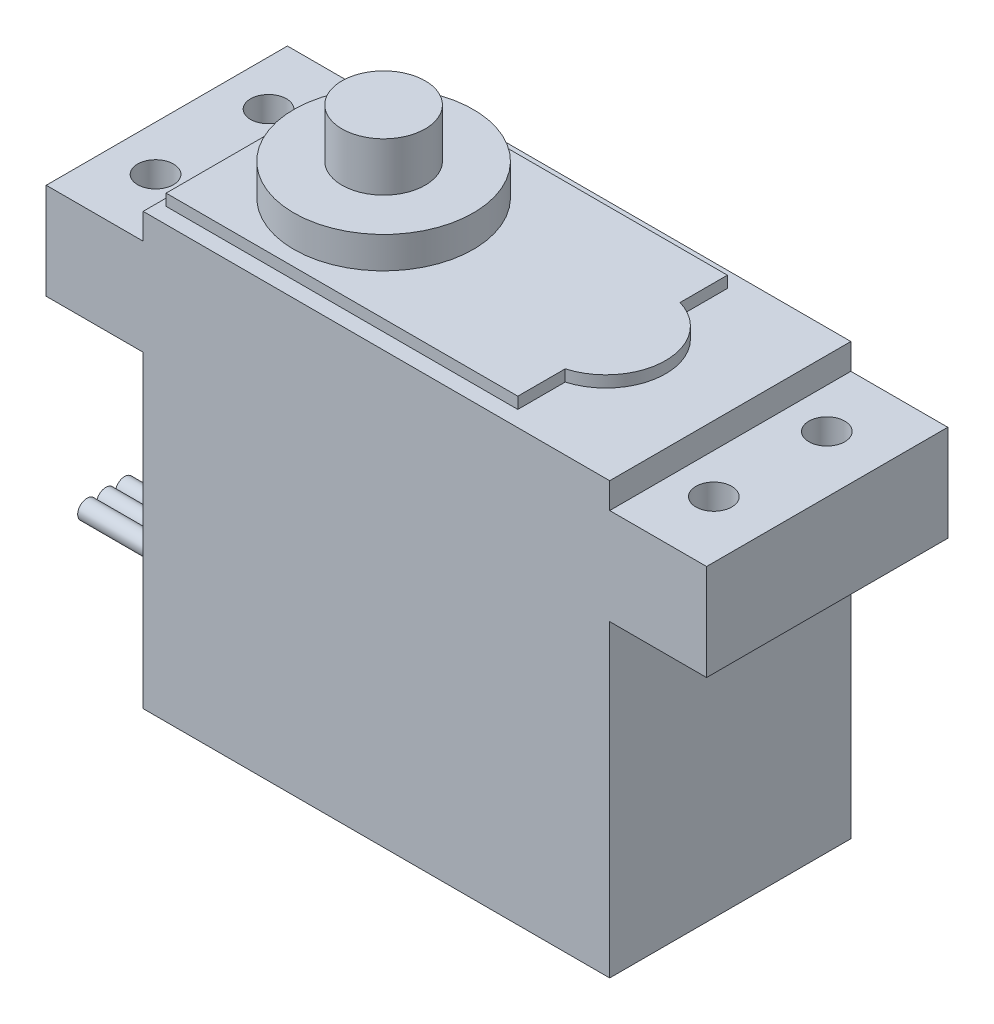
ISO-10303-21;
HEADER;
FILE_DESCRIPTION(('STEP AP214'),'2;1');
FILE_NAME('part.step','',(''),(''),'','','');
FILE_SCHEMA(('AUTOMOTIVE_DESIGN { 1 0 10303 214 1 1 1 1 }'));
ENDSEC;
DATA;
#1=APPLICATION_CONTEXT('core data for automotive mechanical design processes');
#2=APPLICATION_PROTOCOL_DEFINITION('international standard','automotive_design',2000,#1);
#3=PRODUCT_CONTEXT('',#1,'mechanical');
#4=PRODUCT('Part','Part','',(#3));
#5=PRODUCT_RELATED_PRODUCT_CATEGORY('part','',(#4));
#6=PRODUCT_DEFINITION_FORMATION('','',#4);
#7=PRODUCT_DEFINITION_CONTEXT('part definition',#1,'design');
#8=PRODUCT_DEFINITION('design','',#6,#7);
#9=PRODUCT_DEFINITION_SHAPE('','',#8);
#10=(LENGTH_UNIT() NAMED_UNIT(*) SI_UNIT(.MILLI.,.METRE.));
#11=(NAMED_UNIT(*) PLANE_ANGLE_UNIT() SI_UNIT($,.RADIAN.));
#12=(NAMED_UNIT(*) SI_UNIT($,.STERADIAN.) SOLID_ANGLE_UNIT());
#13=UNCERTAINTY_MEASURE_WITH_UNIT(LENGTH_MEASURE(1.E-05),#10,'distance_accuracy_value','');
#14=(GEOMETRIC_REPRESENTATION_CONTEXT(3) GLOBAL_UNCERTAINTY_ASSIGNED_CONTEXT((#13)) GLOBAL_UNIT_ASSIGNED_CONTEXT((#10,
#11,#12)) REPRESENTATION_CONTEXT('',''));
#15=CARTESIAN_POINT('',(0.,0.,0.));
#16=DIRECTION('',(0.,0.,1.));
#17=DIRECTION('',(1.,0.,0.));
#18=AXIS2_PLACEMENT_3D('',#15,#16,#17);
#19=CARTESIAN_POINT('',(-5.5,0.,0.));
#20=DIRECTION('',(1.,0.,0.));
#21=DIRECTION('',(0.,0.,-1.));
#22=AXIS2_PLACEMENT_3D('',#19,#20,#21);
#23=PLANE('',#22);
#24=DIRECTION('',(0.,1.,0.));
#25=VECTOR('',#24,1.);
#26=CARTESIAN_POINT('',(-5.5,1.85,2.45));
#27=LINE('',#26,#25);
#28=CARTESIAN_POINT('',(-5.5,1.85,2.45));
#29=VERTEX_POINT('',#28);
#30=CARTESIAN_POINT('',(-5.5,4.15,2.45));
#31=VERTEX_POINT('',#30);
#32=EDGE_CURVE('E347',#29,#31,#27,.T.);
#33=ORIENTED_EDGE('',*,*,#32,.T.);
#34=DIRECTION('',(0.,0.,-1.));
#35=VECTOR('',#34,1.);
#36=CARTESIAN_POINT('',(-5.5,4.15,-2.45));
#37=LINE('',#36,#35);
#38=CARTESIAN_POINT('',(-5.5,4.15,-2.45));
#39=VERTEX_POINT('',#38);
#40=EDGE_CURVE('E358',#31,#39,#37,.T.);
#41=ORIENTED_EDGE('',*,*,#40,.T.);
#42=DIRECTION('',(0.,-1.,0.));
#43=VECTOR('',#42,1.);
#44=CARTESIAN_POINT('',(-5.5,1.85,-2.45));
#45=LINE('',#44,#43);
#46=CARTESIAN_POINT('',(-5.5,1.85,-2.45));
#47=VERTEX_POINT('',#46);
#48=EDGE_CURVE('E226',#39,#47,#45,.T.);
#49=ORIENTED_EDGE('',*,*,#48,.T.);
#50=DIRECTION('',(0.,0.,1.));
#51=VECTOR('',#50,1.);
#52=CARTESIAN_POINT('',(-5.5,1.85,-2.45));
#53=LINE('',#52,#51);
#54=EDGE_CURVE('E360',#47,#29,#53,.T.);
#55=ORIENTED_EDGE('',*,*,#54,.T.);
#56=EDGE_LOOP('',(#33,#41,#49,#55));
#57=FACE_BOUND('',#56,.T.);
#58=CARTESIAN_POINT('',(-5.5,3.,-1.31));
#59=DIRECTION('',(1.,0.,0.));
#60=DIRECTION('',(0.,0.,-1.));
#61=AXIS2_PLACEMENT_3D('',#58,#59,#60);
#62=CIRCLE('',#61,0.65);
#63=CARTESIAN_POINT('',(-5.5,3.,-1.96));
#64=VERTEX_POINT('',#63);
#65=EDGE_CURVE('E253',#64,#64,#62,.F.);
#66=ORIENTED_EDGE('',*,*,#65,.F.);
#67=EDGE_LOOP('',(#66));
#68=FACE_BOUND('',#67,.T.);
#69=CARTESIAN_POINT('',(-5.5,3.,0.));
#70=DIRECTION('',(1.,0.,0.));
#71=DIRECTION('',(0.,0.,-1.));
#72=AXIS2_PLACEMENT_3D('',#69,#70,#71);
#73=CIRCLE('',#72,0.65);
#74=CARTESIAN_POINT('',(-5.5,3.,-0.65));
#75=VERTEX_POINT('',#74);
#76=EDGE_CURVE('E55',#75,#75,#73,.F.);
#77=ORIENTED_EDGE('',*,*,#76,.F.);
#78=EDGE_LOOP('',(#77));
#79=FACE_BOUND('',#78,.T.);
#80=CARTESIAN_POINT('',(-5.5,3.,1.31));
#81=DIRECTION('',(1.,0.,0.));
#82=DIRECTION('',(0.,0.,-1.));
#83=AXIS2_PLACEMENT_3D('',#80,#81,#82);
#84=CIRCLE('',#83,0.65);
#85=CARTESIAN_POINT('',(-5.5,3.,0.66));
#86=VERTEX_POINT('',#85);
#87=EDGE_CURVE('E13',#86,#86,#84,.F.);
#88=ORIENTED_EDGE('',*,*,#87,.F.);
#89=EDGE_LOOP('',(#88));
#90=FACE_BOUND('',#89,.T.);
#91=ADVANCED_FACE('F47',(#57,#68,#79,#90),#23,.F.);
#92=CARTESIAN_POINT('',(-1.,1.,-3.5));
#93=DIRECTION('',(-1.,0.,0.));
#94=DIRECTION('',(0.,0.,1.));
#95=AXIS2_PLACEMENT_3D('',#92,#93,#94);
#96=PLANE('',#95);
#97=DIRECTION('',(0.,-1.,0.));
#98=VECTOR('',#97,1.);
#99=CARTESIAN_POINT('',(-1.,5.,-3.5));
#100=LINE('',#99,#98);
#101=CARTESIAN_POINT('',(-1.,5.,-3.5));
#102=VERTEX_POINT('',#101);
#103=CARTESIAN_POINT('',(-1.,1.,-3.5));
#104=VERTEX_POINT('',#103);
#105=EDGE_CURVE('E420',#102,#104,#100,.T.);
#106=ORIENTED_EDGE('',*,*,#105,.T.);
#107=DIRECTION('',(0.,0.,1.));
#108=VECTOR('',#107,1.);
#109=CARTESIAN_POINT('',(-1.,1.,-3.5));
#110=LINE('',#109,#108);
#111=CARTESIAN_POINT('',(-1.,1.,3.5));
#112=VERTEX_POINT('',#111);
#113=EDGE_CURVE('E428',#104,#112,#110,.T.);
#114=ORIENTED_EDGE('',*,*,#113,.T.);
#115=DIRECTION('',(0.,1.,0.));
#116=VECTOR('',#115,1.);
#117=CARTESIAN_POINT('',(-1.,5.,3.5));
#118=LINE('',#117,#116);
#119=CARTESIAN_POINT('',(-1.,5.,3.5));
#120=VERTEX_POINT('',#119);
#121=EDGE_CURVE('E431',#112,#120,#118,.T.);
#122=ORIENTED_EDGE('',*,*,#121,.T.);
#123=DIRECTION('',(0.,0.,-1.));
#124=VECTOR('',#123,1.);
#125=CARTESIAN_POINT('',(-1.,5.,-3.5));
#126=LINE('',#125,#124);
#127=EDGE_CURVE('E433',#120,#102,#126,.T.);
#128=ORIENTED_EDGE('',*,*,#127,.T.);
#129=EDGE_LOOP('',(#106,#114,#122,#128));
#130=FACE_BOUND('',#129,.T.);
#131=DIRECTION('',(0.,0.,-1.));
#132=VECTOR('',#131,1.);
#133=CARTESIAN_POINT('',(-1.,4.5,-3.));
#134=LINE('',#133,#132);
#135=CARTESIAN_POINT('',(-1.,4.5,3.));
#136=VERTEX_POINT('',#135);
#137=CARTESIAN_POINT('',(-1.,4.5,-3.));
#138=VERTEX_POINT('',#137);
#139=EDGE_CURVE('E229',#136,#138,#134,.T.);
#140=ORIENTED_EDGE('',*,*,#139,.F.);
#141=DIRECTION('',(0.,1.,0.));
#142=VECTOR('',#141,1.);
#143=CARTESIAN_POINT('',(-1.,4.5,3.));
#144=LINE('',#143,#142);
#145=CARTESIAN_POINT('',(-1.,1.5,3.));
#146=VERTEX_POINT('',#145);
#147=EDGE_CURVE('E240',#146,#136,#144,.T.);
#148=ORIENTED_EDGE('',*,*,#147,.F.);
#149=DIRECTION('',(0.,0.,1.));
#150=VECTOR('',#149,1.);
#151=CARTESIAN_POINT('',(-1.,1.5,-3.));
#152=LINE('',#151,#150);
#153=CARTESIAN_POINT('',(-1.,1.5,-3.));
#154=VERTEX_POINT('',#153);
#155=EDGE_CURVE('E238',#154,#146,#152,.T.);
#156=ORIENTED_EDGE('',*,*,#155,.F.);
#157=DIRECTION('',(0.,-1.,0.));
#158=VECTOR('',#157,1.);
#159=CARTESIAN_POINT('',(-1.,4.5,-3.));
#160=LINE('',#159,#158);
#161=EDGE_CURVE('E223',#138,#154,#160,.T.);
#162=ORIENTED_EDGE('',*,*,#161,.F.);
#163=EDGE_LOOP('',(#140,#148,#156,#162));
#164=FACE_BOUND('',#163,.T.);
#165=ADVANCED_FACE('F237',(#130,#164),#96,.T.);
#166=CARTESIAN_POINT('',(0.,0.,8.4));
#167=DIRECTION('',(1.,0.,0.));
#168=DIRECTION('',(0.,0.,-1.));
#169=AXIS2_PLACEMENT_3D('',#166,#167,#168);
#170=PLANE('',#169);
#171=DIRECTION('',(0.,-1.,0.));
#172=VECTOR('',#171,1.);
#173=CARTESIAN_POINT('',(0.,0.,-8.4));
#174=LINE('',#173,#172);
#175=CARTESIAN_POINT('',(0.,21.5,-8.4));
#176=VERTEX_POINT('',#175);
#177=CARTESIAN_POINT('',(0.,0.,-8.4));
#178=VERTEX_POINT('',#177);
#179=EDGE_CURVE('E567',#176,#178,#174,.T.);
#180=ORIENTED_EDGE('',*,*,#179,.T.);
#181=DIRECTION('',(0.,0.,-1.));
#182=VECTOR('',#181,1.);
#183=CARTESIAN_POINT('',(0.,0.,8.4));
#184=LINE('',#183,#182);
#185=CARTESIAN_POINT('',(0.,0.,8.4));
#186=VERTEX_POINT('',#185);
#187=EDGE_CURVE('E255',#186,#178,#184,.T.);
#188=ORIENTED_EDGE('',*,*,#187,.F.);
#189=DIRECTION('',(0.,-1.,0.));
#190=VECTOR('',#189,1.);
#191=CARTESIAN_POINT('',(0.,0.,8.4));
#192=LINE('',#191,#190);
#193=CARTESIAN_POINT('',(0.,21.5,8.4));
#194=VERTEX_POINT('',#193);
#195=EDGE_CURVE('E540',#194,#186,#192,.T.);
#196=ORIENTED_EDGE('',*,*,#195,.F.);
#197=DIRECTION('',(0.,0.,-1.));
#198=VECTOR('',#197,1.);
#199=CARTESIAN_POINT('',(0.,21.5,8.4));
#200=LINE('',#199,#198);
#201=EDGE_CURVE('E566',#194,#176,#200,.T.);
#202=ORIENTED_EDGE('',*,*,#201,.T.);
#203=EDGE_LOOP('',(#180,#188,#196,#202));
#204=FACE_BOUND('',#203,.T.);
#205=DIRECTION('',(0.,-1.,0.));
#206=VECTOR('',#205,1.);
#207=CARTESIAN_POINT('',(0.,5.,-3.5));
#208=LINE('',#207,#206);
#209=CARTESIAN_POINT('',(0.,5.,-3.5));
#210=VERTEX_POINT('',#209);
#211=CARTESIAN_POINT('',(0.,1.,-3.5));
#212=VERTEX_POINT('',#211);
#213=EDGE_CURVE('E386',#210,#212,#208,.T.);
#214=ORIENTED_EDGE('',*,*,#213,.F.);
#215=DIRECTION('',(0.,0.,-1.));
#216=VECTOR('',#215,1.);
#217=CARTESIAN_POINT('',(0.,5.,-3.5));
#218=LINE('',#217,#216);
#219=CARTESIAN_POINT('',(0.,5.,3.5));
#220=VERTEX_POINT('',#219);
#221=EDGE_CURVE('E429',#220,#210,#218,.T.);
#222=ORIENTED_EDGE('',*,*,#221,.F.);
#223=DIRECTION('',(0.,1.,0.));
#224=VECTOR('',#223,1.);
#225=CARTESIAN_POINT('',(0.,5.,3.5));
#226=LINE('',#225,#224);
#227=CARTESIAN_POINT('',(0.,1.,3.5));
#228=VERTEX_POINT('',#227);
#229=EDGE_CURVE('E439',#228,#220,#226,.T.);
#230=ORIENTED_EDGE('',*,*,#229,.F.);
#231=DIRECTION('',(0.,0.,1.));
#232=VECTOR('',#231,1.);
#233=CARTESIAN_POINT('',(0.,1.,-3.5));
#234=LINE('',#233,#232);
#235=EDGE_CURVE('E70',#212,#228,#234,.T.);
#236=ORIENTED_EDGE('',*,*,#235,.F.);
#237=EDGE_LOOP('',(#214,#222,#230,#236));
#238=FACE_BOUND('',#237,.T.);
#239=ADVANCED_FACE('F49',(#204,#238),#170,.F.);
#240=CARTESIAN_POINT('',(0.,33.,8.4));
#241=DIRECTION('',(0.,1.,0.));
#242=DIRECTION('',(0.,0.,1.));
#243=AXIS2_PLACEMENT_3D('',#240,#241,#242);
#244=PLANE('',#243);
#245=CARTESIAN_POINT('',(8.35,33.,0.));
#246=DIRECTION('',(0.,1.,0.));
#247=DIRECTION('',(0.,0.,1.));
#248=AXIS2_PLACEMENT_3D('',#245,#246,#247);
#249=CIRCLE('',#248,6.25);
#250=CARTESIAN_POINT('',(8.35,33.,6.25));
#251=VERTEX_POINT('',#250);
#252=EDGE_CURVE('E463',#251,#251,#249,.T.);
#253=ORIENTED_EDGE('',*,*,#252,.T.);
#254=EDGE_LOOP('',(#253));
#255=FACE_BOUND('',#254,.T.);
#256=CARTESIAN_POINT('',(8.35,33.,0.));
#257=DIRECTION('',(0.,1.,0.));
#258=DIRECTION('',(0.,0.,1.));
#259=AXIS2_PLACEMENT_3D('',#256,#257,#258);
#260=CIRCLE('',#259,2.9);
#261=CARTESIAN_POINT('',(8.35,33.,2.9));
#262=VERTEX_POINT('',#261);
#263=EDGE_CURVE('E454',#262,#262,#260,.T.);
#264=ORIENTED_EDGE('',*,*,#263,.F.);
#265=EDGE_LOOP('',(#264));
#266=FACE_BOUND('',#265,.T.);
#267=ADVANCED_FACE('F762',(#255,#266),#244,.T.);
#268=CARTESIAN_POINT('',(0.,30.8,8.4));
#269=DIRECTION('',(0.,1.,0.));
#270=DIRECTION('',(0.,0.,1.));
#271=AXIS2_PLACEMENT_3D('',#268,#269,#270);
#272=PLANE('',#271);
#273=CARTESIAN_POINT('',(23.8333333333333,30.8,0.));
#274=DIRECTION('',(0.,1.,0.));
#275=DIRECTION('',(0.,0.,1.));
#276=AXIS2_PLACEMENT_3D('',#273,#274,#275);
#277=CIRCLE('',#276,4.16666666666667);
#278=CARTESIAN_POINT('',(25.,30.8,4.));
#279=VERTEX_POINT('',#278);
#280=CARTESIAN_POINT('',(25.,30.8,-4.));
#281=VERTEX_POINT('',#280);
#282=EDGE_CURVE('E470',#279,#281,#277,.T.);
#283=ORIENTED_EDGE('',*,*,#282,.T.);
#284=DIRECTION('',(0.,0.,-1.));
#285=VECTOR('',#284,1.);
#286=CARTESIAN_POINT('',(25.,30.8,-7.3));
#287=LINE('',#286,#285);
#288=CARTESIAN_POINT('',(25.,30.8,-7.3));
#289=VERTEX_POINT('',#288);
#290=EDGE_CURVE('E504',#281,#289,#287,.T.);
#291=ORIENTED_EDGE('',*,*,#290,.T.);
#292=DIRECTION('',(-1.,0.,0.));
#293=VECTOR('',#292,1.);
#294=CARTESIAN_POINT('',(0.5,30.8,-7.3));
#295=LINE('',#294,#293);
#296=CARTESIAN_POINT('',(0.5,30.8,-7.3));
#297=VERTEX_POINT('',#296);
#298=EDGE_CURVE('E501',#289,#297,#295,.T.);
#299=ORIENTED_EDGE('',*,*,#298,.T.);
#300=DIRECTION('',(0.,0.,1.));
#301=VECTOR('',#300,1.);
#302=CARTESIAN_POINT('',(0.5,30.8,-7.3));
#303=LINE('',#302,#301);
#304=CARTESIAN_POINT('',(0.5,30.8,7.3));
#305=VERTEX_POINT('',#304);
#306=EDGE_CURVE('E498',#297,#305,#303,.T.);
#307=ORIENTED_EDGE('',*,*,#306,.T.);
#308=DIRECTION('',(1.,0.,0.));
#309=VECTOR('',#308,1.);
#310=CARTESIAN_POINT('',(25.,30.8,7.3));
#311=LINE('',#310,#309);
#312=CARTESIAN_POINT('',(25.,30.8,7.3));
#313=VERTEX_POINT('',#312);
#314=EDGE_CURVE('E495',#305,#313,#311,.T.);
#315=ORIENTED_EDGE('',*,*,#314,.T.);
#316=DIRECTION('',(0.,0.,-1.));
#317=VECTOR('',#316,1.);
#318=CARTESIAN_POINT('',(25.,30.8,4.));
#319=LINE('',#318,#317);
#320=EDGE_CURVE('E491',#313,#279,#319,.T.);
#321=ORIENTED_EDGE('',*,*,#320,.T.);
#322=EDGE_LOOP('',(#283,#291,#299,#307,#315,#321));
#323=FACE_BOUND('',#322,.T.);
#324=CARTESIAN_POINT('',(8.35,30.8,0.));
#325=DIRECTION('',(0.,1.,0.));
#326=DIRECTION('',(0.,0.,1.));
#327=AXIS2_PLACEMENT_3D('',#324,#325,#326);
#328=CIRCLE('',#327,6.25);
#329=CARTESIAN_POINT('',(8.35,30.8,6.25));
#330=VERTEX_POINT('',#329);
#331=EDGE_CURVE('E460',#330,#330,#328,.T.);
#332=ORIENTED_EDGE('',*,*,#331,.F.);
#333=EDGE_LOOP('',(#332));
#334=FACE_BOUND('',#333,.T.);
#335=ADVANCED_FACE('F677',(#323,#334),#272,.T.);
#336=CARTESIAN_POINT('',(0.,30.,8.4));
#337=DIRECTION('',(0.,-1.,0.));
#338=DIRECTION('',(0.,0.,-1.));
#339=AXIS2_PLACEMENT_3D('',#336,#337,#338);
#340=PLANE('',#339);
#341=DIRECTION('',(-1.,0.,0.));
#342=VECTOR('',#341,1.);
#343=CARTESIAN_POINT('',(0.,30.,-8.4));
#344=LINE('',#343,#342);
#345=CARTESIAN_POINT('',(32.5,30.,-8.4));
#346=VERTEX_POINT('',#345);
#347=CARTESIAN_POINT('',(0.,30.,-8.4));
#348=VERTEX_POINT('',#347);
#349=EDGE_CURVE('E582',#346,#348,#344,.T.);
#350=ORIENTED_EDGE('',*,*,#349,.T.);
#351=DIRECTION('',(0.,0.,-1.));
#352=VECTOR('',#351,1.);
#353=CARTESIAN_POINT('',(0.,30.,8.4));
#354=LINE('',#353,#352);
#355=CARTESIAN_POINT('',(0.,30.,8.4));
#356=VERTEX_POINT('',#355);
#357=EDGE_CURVE('E602',#356,#348,#354,.T.);
#358=ORIENTED_EDGE('',*,*,#357,.F.);
#359=DIRECTION('',(-1.,0.,0.));
#360=VECTOR('',#359,1.);
#361=CARTESIAN_POINT('',(0.,30.,8.4));
#362=LINE('',#361,#360);
#363=CARTESIAN_POINT('',(32.5,30.,8.4));
#364=VERTEX_POINT('',#363);
#365=EDGE_CURVE('E556',#364,#356,#362,.T.);
#366=ORIENTED_EDGE('',*,*,#365,.F.);
#367=DIRECTION('',(0.,0.,-1.));
#368=VECTOR('',#367,1.);
#369=CARTESIAN_POINT('',(32.5,30.,8.4));
#370=LINE('',#369,#368);
#371=EDGE_CURVE('E605',#364,#346,#370,.T.);
#372=ORIENTED_EDGE('',*,*,#371,.T.);
#373=EDGE_LOOP('',(#350,#358,#366,#372));
#374=FACE_BOUND('',#373,.T.);
#375=DIRECTION('',(0.,0.,-1.));
#376=VECTOR('',#375,1.);
#377=CARTESIAN_POINT('',(25.,30.,-7.3));
#378=LINE('',#377,#376);
#379=CARTESIAN_POINT('',(25.,30.,-4.));
#380=VERTEX_POINT('',#379);
#381=CARTESIAN_POINT('',(25.,30.,-7.3));
#382=VERTEX_POINT('',#381);
#383=EDGE_CURVE('E488',#380,#382,#378,.T.);
#384=ORIENTED_EDGE('',*,*,#383,.F.);
#385=CARTESIAN_POINT('',(23.8333333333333,30.,0.));
#386=DIRECTION('',(0.,1.,0.));
#387=DIRECTION('',(0.,0.,-1.));
#388=AXIS2_PLACEMENT_3D('',#385,#386,#387);
#389=CIRCLE('',#388,4.16666666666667);
#390=CARTESIAN_POINT('',(25.,30.,4.));
#391=VERTEX_POINT('',#390);
#392=EDGE_CURVE('E467',#391,#380,#389,.T.);
#393=ORIENTED_EDGE('',*,*,#392,.F.);
#394=DIRECTION('',(0.,0.,-1.));
#395=VECTOR('',#394,1.);
#396=CARTESIAN_POINT('',(25.,30.,4.));
#397=LINE('',#396,#395);
#398=CARTESIAN_POINT('',(25.,30.,7.3));
#399=VERTEX_POINT('',#398);
#400=EDGE_CURVE('E472',#399,#391,#397,.T.);
#401=ORIENTED_EDGE('',*,*,#400,.F.);
#402=DIRECTION('',(1.,0.,0.));
#403=VECTOR('',#402,1.);
#404=CARTESIAN_POINT('',(25.,30.,7.3));
#405=LINE('',#404,#403);
#406=CARTESIAN_POINT('',(0.5,30.,7.3));
#407=VERTEX_POINT('',#406);
#408=EDGE_CURVE('E476',#407,#399,#405,.T.);
#409=ORIENTED_EDGE('',*,*,#408,.F.);
#410=DIRECTION('',(0.,0.,1.));
#411=VECTOR('',#410,1.);
#412=CARTESIAN_POINT('',(0.5,30.,-7.3));
#413=LINE('',#412,#411);
#414=CARTESIAN_POINT('',(0.5,30.,-7.3));
#415=VERTEX_POINT('',#414);
#416=EDGE_CURVE('E480',#415,#407,#413,.T.);
#417=ORIENTED_EDGE('',*,*,#416,.F.);
#418=DIRECTION('',(-1.,0.,0.));
#419=VECTOR('',#418,1.);
#420=CARTESIAN_POINT('',(0.5,30.,-7.3));
#421=LINE('',#420,#419);
#422=EDGE_CURVE('E484',#382,#415,#421,.T.);
#423=ORIENTED_EDGE('',*,*,#422,.F.);
#424=EDGE_LOOP('',(#384,#393,#401,#409,#417,#423));
#425=FACE_BOUND('',#424,.T.);
#426=ADVANCED_FACE('F673',(#374,#425),#340,.F.);
#427=CARTESIAN_POINT('',(0.,0.,8.4));
#428=DIRECTION('',(0.,1.,0.));
#429=DIRECTION('',(0.,0.,1.));
#430=AXIS2_PLACEMENT_3D('',#427,#428,#429);
#431=PLANE('',#430);
#432=DIRECTION('',(1.,0.,0.));
#433=VECTOR('',#432,1.);
#434=CARTESIAN_POINT('',(0.,0.,-8.4));
#435=LINE('',#434,#433);
#436=CARTESIAN_POINT('',(32.5,0.,-8.4));
#437=VERTEX_POINT('',#436);
#438=EDGE_CURVE('E570',#178,#437,#435,.T.);
#439=ORIENTED_EDGE('',*,*,#438,.T.);
#440=DIRECTION('',(0.,0.,-1.));
#441=VECTOR('',#440,1.);
#442=CARTESIAN_POINT('',(32.5,0.,8.4));
#443=LINE('',#442,#441);
#444=CARTESIAN_POINT('',(32.5,0.,8.4));
#445=VERTEX_POINT('',#444);
#446=EDGE_CURVE('E620',#445,#437,#443,.T.);
#447=ORIENTED_EDGE('',*,*,#446,.F.);
#448=DIRECTION('',(1.,0.,0.));
#449=VECTOR('',#448,1.);
#450=CARTESIAN_POINT('',(0.,0.,8.4));
#451=LINE('',#450,#449);
#452=EDGE_CURVE('E543',#186,#445,#451,.T.);
#453=ORIENTED_EDGE('',*,*,#452,.F.);
#454=ORIENTED_EDGE('',*,*,#187,.T.);
#455=EDGE_LOOP('',(#439,#447,#453,#454));
#456=FACE_BOUND('',#455,.T.);
#457=ADVANCED_FACE('F676',(#456),#431,.F.);
#458=CARTESIAN_POINT('',(32.5,0.,8.4));
#459=DIRECTION('',(-1.,0.,0.));
#460=DIRECTION('',(0.,0.,1.));
#461=AXIS2_PLACEMENT_3D('',#458,#459,#460);
#462=PLANE('',#461);
#463=DIRECTION('',(0.,1.,0.));
#464=VECTOR('',#463,1.);
#465=CARTESIAN_POINT('',(32.5,0.,-8.4));
#466=LINE('',#465,#464);
#467=CARTESIAN_POINT('',(32.5,21.5,-8.4));
#468=VERTEX_POINT('',#467);
#469=EDGE_CURVE('E572',#437,#468,#466,.T.);
#470=ORIENTED_EDGE('',*,*,#469,.T.);
#471=DIRECTION('',(0.,0.,-1.));
#472=VECTOR('',#471,1.);
#473=CARTESIAN_POINT('',(32.5,21.5,8.4));
#474=LINE('',#473,#472);
#475=CARTESIAN_POINT('',(32.5,21.5,8.4));
#476=VERTEX_POINT('',#475);
#477=EDGE_CURVE('E617',#476,#468,#474,.T.);
#478=ORIENTED_EDGE('',*,*,#477,.F.);
#479=DIRECTION('',(0.,1.,0.));
#480=VECTOR('',#479,1.);
#481=CARTESIAN_POINT('',(32.5,0.,8.4));
#482=LINE('',#481,#480);
#483=EDGE_CURVE('E546',#445,#476,#482,.T.);
#484=ORIENTED_EDGE('',*,*,#483,.F.);
#485=ORIENTED_EDGE('',*,*,#446,.T.);
#486=EDGE_LOOP('',(#470,#478,#484,#485));
#487=FACE_BOUND('',#486,.T.);
#488=ADVANCED_FACE('F693',(#487),#462,.F.);
#489=CARTESIAN_POINT('',(32.5,21.5,8.4));
#490=DIRECTION('',(0.,1.,0.));
#491=DIRECTION('',(0.,0.,1.));
#492=AXIS2_PLACEMENT_3D('',#489,#490,#491);
#493=PLANE('',#492);
#494=CARTESIAN_POINT('',(35.29,21.5,3.935));
#495=DIRECTION('',(0.,1.,0.));
#496=DIRECTION('',(0.,0.,1.));
#497=AXIS2_PLACEMENT_3D('',#494,#495,#496);
#498=CIRCLE('',#497,1.25);
#499=CARTESIAN_POINT('',(35.29,21.5,5.185));
#500=VERTEX_POINT('',#499);
#501=EDGE_CURVE('E523',#500,#500,#498,.T.);
#502=ORIENTED_EDGE('',*,*,#501,.T.);
#503=EDGE_LOOP('',(#502));
#504=FACE_BOUND('',#503,.T.);
#505=CARTESIAN_POINT('',(35.29,21.5,-3.935));
#506=DIRECTION('',(0.,1.,0.));
#507=DIRECTION('',(0.,0.,1.));
#508=AXIS2_PLACEMENT_3D('',#505,#506,#507);
#509=CIRCLE('',#508,1.25);
#510=CARTESIAN_POINT('',(35.29,21.5,-2.685));
#511=VERTEX_POINT('',#510);
#512=EDGE_CURVE('E529',#511,#511,#509,.T.);
#513=ORIENTED_EDGE('',*,*,#512,.T.);
#514=EDGE_LOOP('',(#513));
#515=FACE_BOUND('',#514,.T.);
#516=DIRECTION('',(1.,0.,0.));
#517=VECTOR('',#516,1.);
#518=CARTESIAN_POINT('',(32.5,21.5,-8.4));
#519=LINE('',#518,#517);
#520=CARTESIAN_POINT('',(39.25,21.5,-8.4));
#521=VERTEX_POINT('',#520);
#522=EDGE_CURVE('E574',#468,#521,#519,.T.);
#523=ORIENTED_EDGE('',*,*,#522,.T.);
#524=DIRECTION('',(0.,0.,-1.));
#525=VECTOR('',#524,1.);
#526=CARTESIAN_POINT('',(39.25,21.5,8.4));
#527=LINE('',#526,#525);
#528=CARTESIAN_POINT('',(39.25,21.5,8.4));
#529=VERTEX_POINT('',#528);
#530=EDGE_CURVE('E614',#529,#521,#527,.T.);
#531=ORIENTED_EDGE('',*,*,#530,.F.);
#532=DIRECTION('',(1.,0.,0.));
#533=VECTOR('',#532,1.);
#534=CARTESIAN_POINT('',(32.5,21.5,8.4));
#535=LINE('',#534,#533);
#536=EDGE_CURVE('E548',#476,#529,#535,.T.);
#537=ORIENTED_EDGE('',*,*,#536,.F.);
#538=ORIENTED_EDGE('',*,*,#477,.T.);
#539=EDGE_LOOP('',(#523,#531,#537,#538));
#540=FACE_BOUND('',#539,.T.);
#541=ADVANCED_FACE('F689',(#504,#515,#540),#493,.F.);
#542=CARTESIAN_POINT('',(39.25,21.5,8.4));
#543=DIRECTION('',(-1.,0.,0.));
#544=DIRECTION('',(0.,0.,1.));
#545=AXIS2_PLACEMENT_3D('',#542,#543,#544);
#546=PLANE('',#545);
#547=DIRECTION('',(0.,1.,0.));
#548=VECTOR('',#547,1.);
#549=CARTESIAN_POINT('',(39.25,21.5,-8.4));
#550=LINE('',#549,#548);
#551=CARTESIAN_POINT('',(39.25,28.2,-8.4));
#552=VERTEX_POINT('',#551);
#553=EDGE_CURVE('E576',#521,#552,#550,.T.);
#554=ORIENTED_EDGE('',*,*,#553,.T.);
#555=DIRECTION('',(0.,0.,-1.));
#556=VECTOR('',#555,1.);
#557=CARTESIAN_POINT('',(39.25,28.2,8.4));
#558=LINE('',#557,#556);
#559=CARTESIAN_POINT('',(39.25,28.2,8.4));
#560=VERTEX_POINT('',#559);
#561=EDGE_CURVE('E611',#560,#552,#558,.T.);
#562=ORIENTED_EDGE('',*,*,#561,.F.);
#563=DIRECTION('',(0.,1.,0.));
#564=VECTOR('',#563,1.);
#565=CARTESIAN_POINT('',(39.25,21.5,8.4));
#566=LINE('',#565,#564);
#567=EDGE_CURVE('E550',#529,#560,#566,.T.);
#568=ORIENTED_EDGE('',*,*,#567,.F.);
#569=ORIENTED_EDGE('',*,*,#530,.T.);
#570=EDGE_LOOP('',(#554,#562,#568,#569));
#571=FACE_BOUND('',#570,.T.);
#572=ADVANCED_FACE('F685',(#571),#546,.F.);
#573=CARTESIAN_POINT('',(39.25,28.2,8.4));
#574=DIRECTION('',(0.,-1.,0.));
#575=DIRECTION('',(0.,0.,-1.));
#576=AXIS2_PLACEMENT_3D('',#573,#574,#575);
#577=PLANE('',#576);
#578=CARTESIAN_POINT('',(35.29,28.2,3.935));
#579=DIRECTION('',(0.,1.,0.));
#580=DIRECTION('',(0.,0.,1.));
#581=AXIS2_PLACEMENT_3D('',#578,#579,#580);
#582=CIRCLE('',#581,1.25);
#583=CARTESIAN_POINT('',(35.29,28.2,5.185));
#584=VERTEX_POINT('',#583);
#585=EDGE_CURVE('E494',#584,#584,#582,.T.);
#586=ORIENTED_EDGE('',*,*,#585,.F.);
#587=EDGE_LOOP('',(#586));
#588=FACE_BOUND('',#587,.T.);
#589=CARTESIAN_POINT('',(35.29,28.2,-3.935));
#590=DIRECTION('',(0.,1.,0.));
#591=DIRECTION('',(0.,0.,1.));
#592=AXIS2_PLACEMENT_3D('',#589,#590,#591);
#593=CIRCLE('',#592,1.25);
#594=CARTESIAN_POINT('',(35.29,28.2,-2.685));
#595=VERTEX_POINT('',#594);
#596=EDGE_CURVE('E526',#595,#595,#593,.T.);
#597=ORIENTED_EDGE('',*,*,#596,.F.);
#598=EDGE_LOOP('',(#597));
#599=FACE_BOUND('',#598,.T.);
#600=DIRECTION('',(-1.,0.,0.));
#601=VECTOR('',#600,1.);
#602=CARTESIAN_POINT('',(39.25,28.2,-8.4));
#603=LINE('',#602,#601);
#604=CARTESIAN_POINT('',(32.5,28.2,-8.4));
#605=VERTEX_POINT('',#604);
#606=EDGE_CURVE('E578',#552,#605,#603,.T.);
#607=ORIENTED_EDGE('',*,*,#606,.T.);
#608=DIRECTION('',(0.,0.,-1.));
#609=VECTOR('',#608,1.);
#610=CARTESIAN_POINT('',(32.5,28.2,8.4));
#611=LINE('',#610,#609);
#612=CARTESIAN_POINT('',(32.5,28.2,8.4));
#613=VERTEX_POINT('',#612);
#614=EDGE_CURVE('E608',#613,#605,#611,.T.);
#615=ORIENTED_EDGE('',*,*,#614,.F.);
#616=DIRECTION('',(-1.,0.,0.));
#617=VECTOR('',#616,1.);
#618=CARTESIAN_POINT('',(39.25,28.2,8.4));
#619=LINE('',#618,#617);
#620=EDGE_CURVE('E552',#560,#613,#619,.T.);
#621=ORIENTED_EDGE('',*,*,#620,.F.);
#622=ORIENTED_EDGE('',*,*,#561,.T.);
#623=EDGE_LOOP('',(#607,#615,#621,#622));
#624=FACE_BOUND('',#623,.T.);
#625=ADVANCED_FACE('F681',(#588,#599,#624),#577,.F.);
#626=CARTESIAN_POINT('',(32.5,28.2,8.4));
#627=DIRECTION('',(-1.,0.,0.));
#628=DIRECTION('',(0.,0.,1.));
#629=AXIS2_PLACEMENT_3D('',#626,#627,#628);
#630=PLANE('',#629);
#631=DIRECTION('',(0.,1.,0.));
#632=VECTOR('',#631,1.);
#633=CARTESIAN_POINT('',(32.5,28.2,-8.4));
#634=LINE('',#633,#632);
#635=EDGE_CURVE('E580',#605,#346,#634,.T.);
#636=ORIENTED_EDGE('',*,*,#635,.T.);
#637=ORIENTED_EDGE('',*,*,#371,.F.);
#638=DIRECTION('',(0.,1.,0.));
#639=VECTOR('',#638,1.);
#640=CARTESIAN_POINT('',(32.5,28.2,8.4));
#641=LINE('',#640,#639);
#642=EDGE_CURVE('E554',#613,#364,#641,.T.);
#643=ORIENTED_EDGE('',*,*,#642,.F.);
#644=ORIENTED_EDGE('',*,*,#614,.T.);
#645=EDGE_LOOP('',(#636,#637,#643,#644));
#646=FACE_BOUND('',#645,.T.);
#647=ADVANCED_FACE('F671',(#646),#630,.F.);
#648=CARTESIAN_POINT('',(0.,28.2,8.4));
#649=DIRECTION('',(1.,0.,0.));
#650=DIRECTION('',(0.,0.,-1.));
#651=AXIS2_PLACEMENT_3D('',#648,#649,#650);
#652=PLANE('',#651);
#653=DIRECTION('',(0.,-1.,0.));
#654=VECTOR('',#653,1.);
#655=CARTESIAN_POINT('',(0.,28.2,-8.4));
#656=LINE('',#655,#654);
#657=CARTESIAN_POINT('',(0.,28.2,-8.4));
#658=VERTEX_POINT('',#657);
#659=EDGE_CURVE('E584',#348,#658,#656,.T.);
#660=ORIENTED_EDGE('',*,*,#659,.T.);
#661=DIRECTION('',(0.,0.,-1.));
#662=VECTOR('',#661,1.);
#663=CARTESIAN_POINT('',(0.,28.2,8.4));
#664=LINE('',#663,#662);
#665=CARTESIAN_POINT('',(0.,28.2,8.4));
#666=VERTEX_POINT('',#665);
#667=EDGE_CURVE('E599',#666,#658,#664,.T.);
#668=ORIENTED_EDGE('',*,*,#667,.F.);
#669=DIRECTION('',(0.,-1.,0.));
#670=VECTOR('',#669,1.);
#671=CARTESIAN_POINT('',(0.,28.2,8.4));
#672=LINE('',#671,#670);
#673=EDGE_CURVE('E558',#356,#666,#672,.T.);
#674=ORIENTED_EDGE('',*,*,#673,.F.);
#675=ORIENTED_EDGE('',*,*,#357,.T.);
#676=EDGE_LOOP('',(#660,#668,#674,#675));
#677=FACE_BOUND('',#676,.T.);
#678=ADVANCED_FACE('F667',(#677),#652,.F.);
#679=CARTESIAN_POINT('',(0.,28.2,8.4));
#680=DIRECTION('',(0.,-1.,0.));
#681=DIRECTION('',(0.,0.,-1.));
#682=AXIS2_PLACEMENT_3D('',#679,#680,#681);
#683=PLANE('',#682);
#684=CARTESIAN_POINT('',(-3.6,28.2,-3.935));
#685=DIRECTION('',(0.,1.,0.));
#686=DIRECTION('',(0.,0.,1.));
#687=AXIS2_PLACEMENT_3D('',#684,#685,#686);
#688=CIRCLE('',#687,1.25);
#689=CARTESIAN_POINT('',(-3.6,28.2,-2.685));
#690=VERTEX_POINT('',#689);
#691=EDGE_CURVE('E532',#690,#690,#688,.T.);
#692=ORIENTED_EDGE('',*,*,#691,.F.);
#693=EDGE_LOOP('',(#692));
#694=FACE_BOUND('',#693,.T.);
#695=CARTESIAN_POINT('',(-3.6,28.2,3.935));
#696=DIRECTION('',(0.,1.,0.));
#697=DIRECTION('',(0.,0.,1.));
#698=AXIS2_PLACEMENT_3D('',#695,#696,#697);
#699=CIRCLE('',#698,1.25);
#700=CARTESIAN_POINT('',(-3.6,28.2,5.185));
#701=VERTEX_POINT('',#700);
#702=EDGE_CURVE('E536',#701,#701,#699,.T.);
#703=ORIENTED_EDGE('',*,*,#702,.F.);
#704=EDGE_LOOP('',(#703));
#705=FACE_BOUND('',#704,.T.);
#706=DIRECTION('',(-1.,0.,0.));
#707=VECTOR('',#706,1.);
#708=CARTESIAN_POINT('',(0.,28.2,-8.4));
#709=LINE('',#708,#707);
#710=CARTESIAN_POINT('',(-6.75,28.2,-8.4));
#711=VERTEX_POINT('',#710);
#712=EDGE_CURVE('E586',#658,#711,#709,.T.);
#713=ORIENTED_EDGE('',*,*,#712,.T.);
#714=DIRECTION('',(0.,0.,-1.));
#715=VECTOR('',#714,1.);
#716=CARTESIAN_POINT('',(-6.75,28.2,8.4));
#717=LINE('',#716,#715);
#718=CARTESIAN_POINT('',(-6.75,28.2,8.4));
#719=VERTEX_POINT('',#718);
#720=EDGE_CURVE('E596',#719,#711,#717,.T.);
#721=ORIENTED_EDGE('',*,*,#720,.F.);
#722=DIRECTION('',(-1.,0.,0.));
#723=VECTOR('',#722,1.);
#724=CARTESIAN_POINT('',(0.,28.2,8.4));
#725=LINE('',#724,#723);
#726=EDGE_CURVE('E560',#666,#719,#725,.T.);
#727=ORIENTED_EDGE('',*,*,#726,.F.);
#728=ORIENTED_EDGE('',*,*,#667,.T.);
#729=EDGE_LOOP('',(#713,#721,#727,#728));
#730=FACE_BOUND('',#729,.T.);
#731=ADVANCED_FACE('F663',(#694,#705,#730),#683,.F.);
#732=CARTESIAN_POINT('',(-6.75,21.5,8.4));
#733=DIRECTION('',(1.,0.,0.));
#734=DIRECTION('',(0.,0.,-1.));
#735=AXIS2_PLACEMENT_3D('',#732,#733,#734);
#736=PLANE('',#735);
#737=DIRECTION('',(0.,-1.,0.));
#738=VECTOR('',#737,1.);
#739=CARTESIAN_POINT('',(-6.75,21.5,-8.4));
#740=LINE('',#739,#738);
#741=CARTESIAN_POINT('',(-6.75,21.5,-8.4));
#742=VERTEX_POINT('',#741);
#743=EDGE_CURVE('E588',#711,#742,#740,.T.);
#744=ORIENTED_EDGE('',*,*,#743,.T.);
#745=DIRECTION('',(0.,0.,-1.));
#746=VECTOR('',#745,1.);
#747=CARTESIAN_POINT('',(-6.75,21.5,8.4));
#748=LINE('',#747,#746);
#749=CARTESIAN_POINT('',(-6.75,21.5,8.4));
#750=VERTEX_POINT('',#749);
#751=EDGE_CURVE('E593',#750,#742,#748,.T.);
#752=ORIENTED_EDGE('',*,*,#751,.F.);
#753=DIRECTION('',(0.,-1.,0.));
#754=VECTOR('',#753,1.);
#755=CARTESIAN_POINT('',(-6.75,21.5,8.4));
#756=LINE('',#755,#754);
#757=EDGE_CURVE('E562',#719,#750,#756,.T.);
#758=ORIENTED_EDGE('',*,*,#757,.F.);
#759=ORIENTED_EDGE('',*,*,#720,.T.);
#760=EDGE_LOOP('',(#744,#752,#758,#759));
#761=FACE_BOUND('',#760,.T.);
#762=ADVANCED_FACE('F660',(#761),#736,.F.);
#763=CARTESIAN_POINT('',(-6.75,21.5,8.4));
#764=DIRECTION('',(0.,1.,0.));
#765=DIRECTION('',(0.,0.,1.));
#766=AXIS2_PLACEMENT_3D('',#763,#764,#765);
#767=PLANE('',#766);
#768=CARTESIAN_POINT('',(-3.6,21.5,-3.935));
#769=DIRECTION('',(0.,1.,0.));
#770=DIRECTION('',(0.,0.,1.));
#771=AXIS2_PLACEMENT_3D('',#768,#769,#770);
#772=CIRCLE('',#771,1.25);
#773=CARTESIAN_POINT('',(-3.6,21.5,-2.685));
#774=VERTEX_POINT('',#773);
#775=EDGE_CURVE('E535',#774,#774,#772,.T.);
#776=ORIENTED_EDGE('',*,*,#775,.T.);
#777=EDGE_LOOP('',(#776));
#778=FACE_BOUND('',#777,.T.);
#779=CARTESIAN_POINT('',(-3.6,21.5,3.935));
#780=DIRECTION('',(0.,1.,0.));
#781=DIRECTION('',(0.,0.,1.));
#782=AXIS2_PLACEMENT_3D('',#779,#780,#781);
#783=CIRCLE('',#782,1.25);
#784=CARTESIAN_POINT('',(-3.6,21.5,5.185));
#785=VERTEX_POINT('',#784);
#786=EDGE_CURVE('E539',#785,#785,#783,.T.);
#787=ORIENTED_EDGE('',*,*,#786,.T.);
#788=EDGE_LOOP('',(#787));
#789=FACE_BOUND('',#788,.T.);
#790=DIRECTION('',(1.,0.,0.));
#791=VECTOR('',#790,1.);
#792=CARTESIAN_POINT('',(-6.75,21.5,-8.4));
#793=LINE('',#792,#791);
#794=EDGE_CURVE('E544',#742,#176,#793,.T.);
#795=ORIENTED_EDGE('',*,*,#794,.T.);
#796=ORIENTED_EDGE('',*,*,#201,.F.);
#797=DIRECTION('',(1.,0.,0.));
#798=VECTOR('',#797,1.);
#799=CARTESIAN_POINT('',(-6.75,21.5,8.4));
#800=LINE('',#799,#798);
#801=EDGE_CURVE('E564',#750,#194,#800,.T.);
#802=ORIENTED_EDGE('',*,*,#801,.F.);
#803=ORIENTED_EDGE('',*,*,#751,.T.);
#804=EDGE_LOOP('',(#795,#796,#802,#803));
#805=FACE_BOUND('',#804,.T.);
#806=ADVANCED_FACE('F630',(#778,#789,#805),#767,.F.);
#807=CARTESIAN_POINT('',(0.,21.5,8.4));
#808=DIRECTION('',(0.,0.,-1.));
#809=DIRECTION('',(-1.,0.,0.));
#810=AXIS2_PLACEMENT_3D('',#807,#808,#809);
#811=PLANE('',#810);
#812=ORIENTED_EDGE('',*,*,#195,.T.);
#813=ORIENTED_EDGE('',*,*,#452,.T.);
#814=ORIENTED_EDGE('',*,*,#483,.T.);
#815=ORIENTED_EDGE('',*,*,#536,.T.);
#816=ORIENTED_EDGE('',*,*,#567,.T.);
#817=ORIENTED_EDGE('',*,*,#620,.T.);
#818=ORIENTED_EDGE('',*,*,#642,.T.);
#819=ORIENTED_EDGE('',*,*,#365,.T.);
#820=ORIENTED_EDGE('',*,*,#673,.T.);
#821=ORIENTED_EDGE('',*,*,#726,.T.);
#822=ORIENTED_EDGE('',*,*,#757,.T.);
#823=ORIENTED_EDGE('',*,*,#801,.T.);
#824=EDGE_LOOP('',(#812,#813,#814,#815,#816,#817,#818,#819,#820,#821,#822,#823));
#825=FACE_BOUND('',#824,.T.);
#826=ADVANCED_FACE('F651',(#825),#811,.F.);
#827=CARTESIAN_POINT('',(0.,21.5,-8.4));
#828=DIRECTION('',(0.,0.,-1.));
#829=DIRECTION('',(-1.,0.,0.));
#830=AXIS2_PLACEMENT_3D('',#827,#828,#829);
#831=PLANE('',#830);
#832=ORIENTED_EDGE('',*,*,#179,.F.);
#833=ORIENTED_EDGE('',*,*,#794,.F.);
#834=ORIENTED_EDGE('',*,*,#743,.F.);
#835=ORIENTED_EDGE('',*,*,#712,.F.);
#836=ORIENTED_EDGE('',*,*,#659,.F.);
#837=ORIENTED_EDGE('',*,*,#349,.F.);
#838=ORIENTED_EDGE('',*,*,#635,.F.);
#839=ORIENTED_EDGE('',*,*,#606,.F.);
#840=ORIENTED_EDGE('',*,*,#553,.F.);
#841=ORIENTED_EDGE('',*,*,#522,.F.);
#842=ORIENTED_EDGE('',*,*,#469,.F.);
#843=ORIENTED_EDGE('',*,*,#438,.F.);
#844=EDGE_LOOP('',(#832,#833,#834,#835,#836,#837,#838,#839,#840,#841,#842,#843));
#845=FACE_BOUND('',#844,.T.);
#846=ADVANCED_FACE('F646',(#845),#831,.T.);
#847=CARTESIAN_POINT('',(-3.6,0.,3.935));
#848=DIRECTION('',(0.,1.,0.));
#849=DIRECTION('',(0.,0.,1.));
#850=AXIS2_PLACEMENT_3D('',#847,#848,#849);
#851=CYLINDRICAL_SURFACE('',#850,1.25);
#852=ORIENTED_EDGE('',*,*,#702,.T.);
#853=EDGE_LOOP('',(#852));
#854=FACE_BOUND('',#853,.T.);
#855=ORIENTED_EDGE('',*,*,#786,.F.);
#856=EDGE_LOOP('',(#855));
#857=FACE_BOUND('',#856,.T.);
#858=ADVANCED_FACE('F636',(#854,#857),#851,.F.);
#859=CARTESIAN_POINT('',(-3.6,0.,-3.935));
#860=DIRECTION('',(0.,1.,0.));
#861=DIRECTION('',(0.,0.,1.));
#862=AXIS2_PLACEMENT_3D('',#859,#860,#861);
#863=CYLINDRICAL_SURFACE('',#862,1.25);
#864=ORIENTED_EDGE('',*,*,#691,.T.);
#865=EDGE_LOOP('',(#864));
#866=FACE_BOUND('',#865,.T.);
#867=ORIENTED_EDGE('',*,*,#775,.F.);
#868=EDGE_LOOP('',(#867));
#869=FACE_BOUND('',#868,.T.);
#870=ADVANCED_FACE('F633',(#866,#869),#863,.F.);
#871=CARTESIAN_POINT('',(35.29,0.,-3.935));
#872=DIRECTION('',(0.,1.,0.));
#873=DIRECTION('',(0.,0.,1.));
#874=AXIS2_PLACEMENT_3D('',#871,#872,#873);
#875=CYLINDRICAL_SURFACE('',#874,1.25);
#876=ORIENTED_EDGE('',*,*,#596,.T.);
#877=EDGE_LOOP('',(#876));
#878=FACE_BOUND('',#877,.T.);
#879=ORIENTED_EDGE('',*,*,#512,.F.);
#880=EDGE_LOOP('',(#879));
#881=FACE_BOUND('',#880,.T.);
#882=ADVANCED_FACE('F635',(#878,#881),#875,.F.);
#883=CARTESIAN_POINT('',(35.29,0.,3.935));
#884=DIRECTION('',(0.,1.,0.));
#885=DIRECTION('',(0.,0.,1.));
#886=AXIS2_PLACEMENT_3D('',#883,#884,#885);
#887=CYLINDRICAL_SURFACE('',#886,1.25);
#888=ORIENTED_EDGE('',*,*,#585,.T.);
#889=EDGE_LOOP('',(#888));
#890=FACE_BOUND('',#889,.T.);
#891=ORIENTED_EDGE('',*,*,#501,.F.);
#892=EDGE_LOOP('',(#891));
#893=FACE_BOUND('',#892,.T.);
#894=ADVANCED_FACE('F643',(#890,#893),#887,.F.);
#895=CARTESIAN_POINT('',(25.,92.7353496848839,-7.3));
#896=DIRECTION('',(-1.,0.,0.));
#897=DIRECTION('',(0.,0.,1.));
#898=AXIS2_PLACEMENT_3D('',#895,#896,#897);
#899=PLANE('',#898);
#900=ORIENTED_EDGE('',*,*,#290,.F.);
#901=DIRECTION('',(0.,-1.,0.));
#902=VECTOR('',#901,1.);
#903=CARTESIAN_POINT('',(25.,92.7353496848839,-4.));
#904=LINE('',#903,#902);
#905=EDGE_CURVE('E466',#281,#380,#904,.T.);
#906=ORIENTED_EDGE('',*,*,#905,.T.);
#907=ORIENTED_EDGE('',*,*,#383,.T.);
#908=DIRECTION('',(0.,-1.,0.));
#909=VECTOR('',#908,1.);
#910=CARTESIAN_POINT('',(25.,92.7353496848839,-7.3));
#911=LINE('',#910,#909);
#912=EDGE_CURVE('E487',#289,#382,#911,.T.);
#913=ORIENTED_EDGE('',*,*,#912,.F.);
#914=EDGE_LOOP('',(#900,#906,#907,#913));
#915=FACE_BOUND('',#914,.T.);
#916=ADVANCED_FACE('F744',(#915),#899,.F.);
#917=CARTESIAN_POINT('',(0.5,92.7353496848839,-7.3));
#918=DIRECTION('',(0.,0.,1.));
#919=DIRECTION('',(1.,0.,0.));
#920=AXIS2_PLACEMENT_3D('',#917,#918,#919);
#921=PLANE('',#920);
#922=ORIENTED_EDGE('',*,*,#298,.F.);
#923=ORIENTED_EDGE('',*,*,#912,.T.);
#924=ORIENTED_EDGE('',*,*,#422,.T.);
#925=DIRECTION('',(0.,-1.,0.));
#926=VECTOR('',#925,1.);
#927=CARTESIAN_POINT('',(0.5,92.7353496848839,-7.3));
#928=LINE('',#927,#926);
#929=EDGE_CURVE('E483',#297,#415,#928,.T.);
#930=ORIENTED_EDGE('',*,*,#929,.F.);
#931=EDGE_LOOP('',(#922,#923,#924,#930));
#932=FACE_BOUND('',#931,.T.);
#933=ADVANCED_FACE('F758',(#932),#921,.F.);
#934=CARTESIAN_POINT('',(0.5,92.7353496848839,-7.3));
#935=DIRECTION('',(1.,0.,0.));
#936=DIRECTION('',(0.,0.,-1.));
#937=AXIS2_PLACEMENT_3D('',#934,#935,#936);
#938=PLANE('',#937);
#939=ORIENTED_EDGE('',*,*,#306,.F.);
#940=ORIENTED_EDGE('',*,*,#929,.T.);
#941=ORIENTED_EDGE('',*,*,#416,.T.);
#942=DIRECTION('',(0.,-1.,0.));
#943=VECTOR('',#942,1.);
#944=CARTESIAN_POINT('',(0.5,92.7353496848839,7.3));
#945=LINE('',#944,#943);
#946=EDGE_CURVE('E479',#305,#407,#945,.T.);
#947=ORIENTED_EDGE('',*,*,#946,.F.);
#948=EDGE_LOOP('',(#939,#940,#941,#947));
#949=FACE_BOUND('',#948,.T.);
#950=ADVANCED_FACE('F755',(#949),#938,.F.);
#951=CARTESIAN_POINT('',(25.,92.7353496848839,7.3));
#952=DIRECTION('',(0.,0.,-1.));
#953=DIRECTION('',(-1.,0.,0.));
#954=AXIS2_PLACEMENT_3D('',#951,#952,#953);
#955=PLANE('',#954);
#956=ORIENTED_EDGE('',*,*,#314,.F.);
#957=ORIENTED_EDGE('',*,*,#946,.T.);
#958=ORIENTED_EDGE('',*,*,#408,.T.);
#959=DIRECTION('',(0.,-1.,0.));
#960=VECTOR('',#959,1.);
#961=CARTESIAN_POINT('',(25.,92.7353496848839,7.3));
#962=LINE('',#961,#960);
#963=EDGE_CURVE('E475',#313,#399,#962,.T.);
#964=ORIENTED_EDGE('',*,*,#963,.F.);
#965=EDGE_LOOP('',(#956,#957,#958,#964));
#966=FACE_BOUND('',#965,.T.);
#967=ADVANCED_FACE('F753',(#966),#955,.F.);
#968=CARTESIAN_POINT('',(25.,92.7353496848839,4.));
#969=DIRECTION('',(-1.,0.,0.));
#970=DIRECTION('',(0.,0.,1.));
#971=AXIS2_PLACEMENT_3D('',#968,#969,#970);
#972=PLANE('',#971);
#973=ORIENTED_EDGE('',*,*,#320,.F.);
#974=ORIENTED_EDGE('',*,*,#963,.T.);
#975=ORIENTED_EDGE('',*,*,#400,.T.);
#976=DIRECTION('',(0.,-1.,0.));
#977=VECTOR('',#976,1.);
#978=CARTESIAN_POINT('',(25.,92.7353496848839,4.));
#979=LINE('',#978,#977);
#980=EDGE_CURVE('E471',#279,#391,#979,.T.);
#981=ORIENTED_EDGE('',*,*,#980,.F.);
#982=EDGE_LOOP('',(#973,#974,#975,#981));
#983=FACE_BOUND('',#982,.T.);
#984=ADVANCED_FACE('F749',(#983),#972,.F.);
#985=CARTESIAN_POINT('',(23.8333333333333,92.7353496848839,0.));
#986=DIRECTION('',(0.,-1.,0.));
#987=DIRECTION('',(0.,0.,-1.));
#988=AXIS2_PLACEMENT_3D('',#985,#986,#987);
#989=CYLINDRICAL_SURFACE('',#988,4.16666666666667);
#990=ORIENTED_EDGE('',*,*,#282,.F.);
#991=ORIENTED_EDGE('',*,*,#980,.T.);
#992=ORIENTED_EDGE('',*,*,#392,.T.);
#993=ORIENTED_EDGE('',*,*,#905,.F.);
#994=EDGE_LOOP('',(#990,#991,#992,#993));
#995=FACE_BOUND('',#994,.T.);
#996=ADVANCED_FACE('F747',(#995),#989,.T.);
#997=CARTESIAN_POINT('',(8.35,83.6776695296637,0.));
#998=DIRECTION('',(0.,-1.,0.));
#999=DIRECTION('',(0.,0.,-1.));
#1000=AXIS2_PLACEMENT_3D('',#997,#998,#999);
#1001=CYLINDRICAL_SURFACE('',#1000,6.25);
#1002=ORIENTED_EDGE('',*,*,#331,.T.);
#1003=EDGE_LOOP('',(#1002));
#1004=FACE_BOUND('',#1003,.T.);
#1005=ORIENTED_EDGE('',*,*,#252,.F.);
#1006=EDGE_LOOP('',(#1005));
#1007=FACE_BOUND('',#1006,.T.);
#1008=ADVANCED_FACE('F766',(#1004,#1007),#1001,.T.);
#1009=CARTESIAN_POINT('',(8.35,81.002438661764,0.));
#1010=DIRECTION('',(0.,-1.,0.));
#1011=DIRECTION('',(0.,0.,-1.));
#1012=AXIS2_PLACEMENT_3D('',#1009,#1010,#1011);
#1013=CYLINDRICAL_SURFACE('',#1012,2.9);
#1014=ORIENTED_EDGE('',*,*,#263,.T.);
#1015=EDGE_LOOP('',(#1014));
#1016=FACE_BOUND('',#1015,.T.);
#1017=CARTESIAN_POINT('',(8.35,36.4,0.));
#1018=DIRECTION('',(0.,1.,0.));
#1019=DIRECTION('',(0.,0.,1.));
#1020=AXIS2_PLACEMENT_3D('',#1017,#1018,#1019);
#1021=CIRCLE('',#1020,2.9);
#1022=CARTESIAN_POINT('',(8.35,36.4,2.9));
#1023=VERTEX_POINT('',#1022);
#1024=EDGE_CURVE('E457',#1023,#1023,#1021,.T.);
#1025=ORIENTED_EDGE('',*,*,#1024,.F.);
#1026=EDGE_LOOP('',(#1025));
#1027=FACE_BOUND('',#1026,.T.);
#1028=ADVANCED_FACE('F769',(#1016,#1027),#1013,.T.);
#1029=CARTESIAN_POINT('',(0.,36.4,8.4));
#1030=DIRECTION('',(0.,1.,0.));
#1031=DIRECTION('',(0.,0.,1.));
#1032=AXIS2_PLACEMENT_3D('',#1029,#1030,#1031);
#1033=PLANE('',#1032);
#1034=ORIENTED_EDGE('',*,*,#1024,.T.);
#1035=EDGE_LOOP('',(#1034));
#1036=FACE_BOUND('',#1035,.T.);
#1037=ADVANCED_FACE('F780',(#1036),#1033,.T.);
#1038=CARTESIAN_POINT('',(-1.,5.,-3.5));
#1039=DIRECTION('',(0.,0.,1.));
#1040=DIRECTION('',(0.,-1.,0.));
#1041=AXIS2_PLACEMENT_3D('',#1038,#1039,#1040);
#1042=PLANE('',#1041);
#1043=ORIENTED_EDGE('',*,*,#213,.T.);
#1044=DIRECTION('',(1.,0.,0.));
#1045=VECTOR('',#1044,1.);
#1046=CARTESIAN_POINT('',(-1.,1.,-3.5));
#1047=LINE('',#1046,#1045);
#1048=EDGE_CURVE('E452',#104,#212,#1047,.T.);
#1049=ORIENTED_EDGE('',*,*,#1048,.F.);
#1050=ORIENTED_EDGE('',*,*,#105,.F.);
#1051=DIRECTION('',(1.,0.,0.));
#1052=VECTOR('',#1051,1.);
#1053=CARTESIAN_POINT('',(-1.,5.,-3.5));
#1054=LINE('',#1053,#1052);
#1055=EDGE_CURVE('E435',#102,#210,#1054,.T.);
#1056=ORIENTED_EDGE('',*,*,#1055,.T.);
#1057=EDGE_LOOP('',(#1043,#1049,#1050,#1056));
#1058=FACE_BOUND('',#1057,.T.);
#1059=ADVANCED_FACE('F785',(#1058),#1042,.F.);
#1060=CARTESIAN_POINT('',(-1.,1.,-3.5));
#1061=DIRECTION('',(0.,1.,0.));
#1062=DIRECTION('',(0.,0.,1.));
#1063=AXIS2_PLACEMENT_3D('',#1060,#1061,#1062);
#1064=PLANE('',#1063);
#1065=ORIENTED_EDGE('',*,*,#235,.T.);
#1066=DIRECTION('',(1.,0.,0.));
#1067=VECTOR('',#1066,1.);
#1068=CARTESIAN_POINT('',(-1.,1.,3.5));
#1069=LINE('',#1068,#1067);
#1070=EDGE_CURVE('E449',#112,#228,#1069,.T.);
#1071=ORIENTED_EDGE('',*,*,#1070,.F.);
#1072=ORIENTED_EDGE('',*,*,#113,.F.);
#1073=ORIENTED_EDGE('',*,*,#1048,.T.);
#1074=EDGE_LOOP('',(#1065,#1071,#1072,#1073));
#1075=FACE_BOUND('',#1074,.T.);
#1076=ADVANCED_FACE('F790',(#1075),#1064,.F.);
#1077=CARTESIAN_POINT('',(-1.,5.,3.5));
#1078=DIRECTION('',(0.,0.,-1.));
#1079=DIRECTION('',(-1.,0.,0.));
#1080=AXIS2_PLACEMENT_3D('',#1077,#1078,#1079);
#1081=PLANE('',#1080);
#1082=ORIENTED_EDGE('',*,*,#229,.T.);
#1083=DIRECTION('',(1.,0.,0.));
#1084=VECTOR('',#1083,1.);
#1085=CARTESIAN_POINT('',(-1.,5.,3.5));
#1086=LINE('',#1085,#1084);
#1087=EDGE_CURVE('E446',#120,#220,#1086,.T.);
#1088=ORIENTED_EDGE('',*,*,#1087,.F.);
#1089=ORIENTED_EDGE('',*,*,#121,.F.);
#1090=ORIENTED_EDGE('',*,*,#1070,.T.);
#1091=EDGE_LOOP('',(#1082,#1088,#1089,#1090));
#1092=FACE_BOUND('',#1091,.T.);
#1093=ADVANCED_FACE('F942',(#1092),#1081,.F.);
#1094=CARTESIAN_POINT('',(-1.,5.,-3.5));
#1095=DIRECTION('',(0.,-1.,0.));
#1096=DIRECTION('',(0.,0.,-1.));
#1097=AXIS2_PLACEMENT_3D('',#1094,#1095,#1096);
#1098=PLANE('',#1097);
#1099=ORIENTED_EDGE('',*,*,#221,.T.);
#1100=ORIENTED_EDGE('',*,*,#1055,.F.);
#1101=ORIENTED_EDGE('',*,*,#127,.F.);
#1102=ORIENTED_EDGE('',*,*,#1087,.T.);
#1103=EDGE_LOOP('',(#1099,#1100,#1101,#1102));
#1104=FACE_BOUND('',#1103,.T.);
#1105=ADVANCED_FACE('F299',(#1104),#1098,.F.);
#1106=CARTESIAN_POINT('',(-0.353908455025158,4.55025156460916,0.));
#1107=DIRECTION('',(0.0775435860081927,-0.996988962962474,0.));
#1108=DIRECTION('',(0.996988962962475,0.0775435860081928,0.));
#1109=AXIS2_PLACEMENT_3D('',#1106,#1107,#1108);
#1110=PLANE('',#1109);
#1111=DIRECTION('',(-0.989668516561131,-0.0769742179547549,0.120959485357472));
#1112=VECTOR('',#1111,1.);
#1113=CARTESIAN_POINT('',(-1.,4.5,-3.));
#1114=LINE('',#1113,#1112);
#1115=EDGE_CURVE('E220',#138,#39,#1114,.T.);
#1116=ORIENTED_EDGE('',*,*,#1115,.T.);
#1117=ORIENTED_EDGE('',*,*,#40,.F.);
#1118=DIRECTION('',(-0.989668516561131,-0.0769742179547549,-0.120959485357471));
#1119=VECTOR('',#1118,1.);
#1120=CARTESIAN_POINT('',(-1.,4.5,3.));
#1121=LINE('',#1120,#1119);
#1122=EDGE_CURVE('E62',#136,#31,#1121,.T.);
#1123=ORIENTED_EDGE('',*,*,#1122,.F.);
#1124=ORIENTED_EDGE('',*,*,#139,.T.);
#1125=EDGE_LOOP('',(#1116,#1117,#1123,#1124));
#1126=FACE_BOUND('',#1125,.T.);
#1127=ADVANCED_FACE('F232',(#1126),#1110,.F.);
#1128=CARTESIAN_POINT('',(-0.375988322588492,0.,3.07626809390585));
#1129=DIRECTION('',(0.121319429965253,0.,-0.992613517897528));
#1130=DIRECTION('',(-0.992613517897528,0.,-0.121319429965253));
#1131=AXIS2_PLACEMENT_3D('',#1128,#1129,#1130);
#1132=PLANE('',#1131);
#1133=ORIENTED_EDGE('',*,*,#1122,.T.);
#1134=ORIENTED_EDGE('',*,*,#32,.F.);
#1135=DIRECTION('',(-0.989668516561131,0.0769742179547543,-0.120959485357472));
#1136=VECTOR('',#1135,1.);
#1137=CARTESIAN_POINT('',(-1.,1.5,3.));
#1138=LINE('',#1137,#1136);
#1139=EDGE_CURVE('E356',#146,#29,#1138,.T.);
#1140=ORIENTED_EDGE('',*,*,#1139,.F.);
#1141=ORIENTED_EDGE('',*,*,#147,.T.);
#1142=EDGE_LOOP('',(#1133,#1134,#1140,#1141));
#1143=FACE_BOUND('',#1142,.T.);
#1144=ADVANCED_FACE('F298',(#1143),#1132,.F.);
#1145=CARTESIAN_POINT('',(-0.375988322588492,0.,-3.07626809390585));
#1146=DIRECTION('',(0.121319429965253,0.,0.992613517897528));
#1147=DIRECTION('',(0.992613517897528,0.,-0.121319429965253));
#1148=AXIS2_PLACEMENT_3D('',#1145,#1146,#1147);
#1149=PLANE('',#1148);
#1150=DIRECTION('',(-0.989668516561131,0.0769742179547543,0.120959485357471));
#1151=VECTOR('',#1150,1.);
#1152=CARTESIAN_POINT('',(-1.,1.5,-3.));
#1153=LINE('',#1152,#1151);
#1154=EDGE_CURVE('E361',#154,#47,#1153,.T.);
#1155=ORIENTED_EDGE('',*,*,#1154,.T.);
#1156=ORIENTED_EDGE('',*,*,#48,.F.);
#1157=ORIENTED_EDGE('',*,*,#1115,.F.);
#1158=ORIENTED_EDGE('',*,*,#161,.T.);
#1159=EDGE_LOOP('',(#1155,#1156,#1157,#1158));
#1160=FACE_BOUND('',#1159,.T.);
#1161=ADVANCED_FACE('F221',(#1160),#1149,.F.);
#1162=CARTESIAN_POINT('',(0.109952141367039,1.41367038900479,0.));
#1163=DIRECTION('',(0.0775435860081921,0.996988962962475,0.));
#1164=DIRECTION('',(-0.996988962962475,0.0775435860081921,0.));
#1165=AXIS2_PLACEMENT_3D('',#1162,#1163,#1164);
#1166=PLANE('',#1165);
#1167=ORIENTED_EDGE('',*,*,#1139,.T.);
#1168=ORIENTED_EDGE('',*,*,#54,.F.);
#1169=ORIENTED_EDGE('',*,*,#1154,.F.);
#1170=ORIENTED_EDGE('',*,*,#155,.T.);
#1171=EDGE_LOOP('',(#1167,#1168,#1169,#1170));
#1172=FACE_BOUND('',#1171,.T.);
#1173=ADVANCED_FACE('F293',(#1172),#1166,.F.);
#1174=CARTESIAN_POINT('',(-11.,3.,-1.31));
#1175=DIRECTION('',(1.,0.,0.));
#1176=DIRECTION('',(0.,0.,-1.));
#1177=AXIS2_PLACEMENT_3D('',#1174,#1175,#1176);
#1178=CYLINDRICAL_SURFACE('',#1177,0.65);
#1179=CARTESIAN_POINT('',(-11.,3.,-1.31));
#1180=DIRECTION('',(-1.,0.,0.));
#1181=DIRECTION('',(0.,0.,1.));
#1182=AXIS2_PLACEMENT_3D('',#1179,#1180,#1181);
#1183=CIRCLE('',#1182,0.65);
#1184=CARTESIAN_POINT('',(-11.,3.,-0.66));
#1185=VERTEX_POINT('',#1184);
#1186=EDGE_CURVE('E250',#1185,#1185,#1183,.T.);
#1187=ORIENTED_EDGE('',*,*,#1186,.F.);
#1188=EDGE_LOOP('',(#1187));
#1189=FACE_BOUND('',#1188,.T.);
#1190=ORIENTED_EDGE('',*,*,#65,.T.);
#1191=EDGE_LOOP('',(#1190));
#1192=FACE_BOUND('',#1191,.T.);
#1193=ADVANCED_FACE('F289',(#1189,#1192),#1178,.T.);
#1194=CARTESIAN_POINT('',(-11.,3.,-1.31));
#1195=DIRECTION('',(-1.,0.,0.));
#1196=DIRECTION('',(0.,0.,1.));
#1197=AXIS2_PLACEMENT_3D('',#1194,#1195,#1196);
#1198=PLANE('',#1197);
#1199=ORIENTED_EDGE('',*,*,#1186,.T.);
#1200=EDGE_LOOP('',(#1199));
#1201=FACE_BOUND('',#1200,.T.);
#1202=ADVANCED_FACE('F285',(#1201),#1198,.T.);
#1203=CARTESIAN_POINT('',(-11.,3.,0.));
#1204=DIRECTION('',(1.,0.,0.));
#1205=DIRECTION('',(0.,0.,-1.));
#1206=AXIS2_PLACEMENT_3D('',#1203,#1204,#1205);
#1207=CYLINDRICAL_SURFACE('',#1206,0.65);
#1208=CARTESIAN_POINT('',(-11.,3.,0.));
#1209=DIRECTION('',(-1.,0.,0.));
#1210=DIRECTION('',(0.,0.,1.));
#1211=AXIS2_PLACEMENT_3D('',#1208,#1209,#1210);
#1212=CIRCLE('',#1211,0.65);
#1213=CARTESIAN_POINT('',(-11.,3.,0.65));
#1214=VERTEX_POINT('',#1213);
#1215=EDGE_CURVE('E375',#1214,#1214,#1212,.T.);
#1216=ORIENTED_EDGE('',*,*,#1215,.F.);
#1217=EDGE_LOOP('',(#1216));
#1218=FACE_BOUND('',#1217,.T.);
#1219=ORIENTED_EDGE('',*,*,#76,.T.);
#1220=EDGE_LOOP('',(#1219));
#1221=FACE_BOUND('',#1220,.T.);
#1222=ADVANCED_FACE('F259',(#1218,#1221),#1207,.T.);
#1223=CARTESIAN_POINT('',(-11.,3.,0.));
#1224=DIRECTION('',(-1.,0.,0.));
#1225=DIRECTION('',(0.,0.,1.));
#1226=AXIS2_PLACEMENT_3D('',#1223,#1224,#1225);
#1227=PLANE('',#1226);
#1228=ORIENTED_EDGE('',*,*,#1215,.T.);
#1229=EDGE_LOOP('',(#1228));
#1230=FACE_BOUND('',#1229,.T.);
#1231=ADVANCED_FACE('F270',(#1230),#1227,.T.);
#1232=CARTESIAN_POINT('',(-11.,3.,1.31));
#1233=DIRECTION('',(1.,0.,0.));
#1234=DIRECTION('',(0.,0.,-1.));
#1235=AXIS2_PLACEMENT_3D('',#1232,#1233,#1234);
#1236=CYLINDRICAL_SURFACE('',#1235,0.65);
#1237=CARTESIAN_POINT('',(-11.,3.,1.31));
#1238=DIRECTION('',(-1.,0.,0.));
#1239=DIRECTION('',(0.,0.,1.));
#1240=AXIS2_PLACEMENT_3D('',#1237,#1238,#1239);
#1241=CIRCLE('',#1240,0.65);
#1242=CARTESIAN_POINT('',(-11.,3.,1.96));
#1243=VERTEX_POINT('',#1242);
#1244=EDGE_CURVE('E378',#1243,#1243,#1241,.T.);
#1245=ORIENTED_EDGE('',*,*,#1244,.F.);
#1246=EDGE_LOOP('',(#1245));
#1247=FACE_BOUND('',#1246,.T.);
#1248=ORIENTED_EDGE('',*,*,#87,.T.);
#1249=EDGE_LOOP('',(#1248));
#1250=FACE_BOUND('',#1249,.T.);
#1251=ADVANCED_FACE('F267',(#1247,#1250),#1236,.T.);
#1252=CARTESIAN_POINT('',(-11.,3.,1.31));
#1253=DIRECTION('',(-1.,0.,0.));
#1254=DIRECTION('',(0.,0.,1.));
#1255=AXIS2_PLACEMENT_3D('',#1252,#1253,#1254);
#1256=PLANE('',#1255);
#1257=ORIENTED_EDGE('',*,*,#1244,.T.);
#1258=EDGE_LOOP('',(#1257));
#1259=FACE_BOUND('',#1258,.T.);
#1260=ADVANCED_FACE('F269',(#1259),#1256,.T.);
#1261=CLOSED_SHELL('',(#91,#165,#239,#267,#335,#426,#457,#488,#541,#572,#625,#647,#678,#731,
#762,#806,#826,#846,#858,#870,#882,#894,#916,#933,#950,#967,#984,#996,#1008,#1028,#1037,#1059,
#1076,#1093,#1105,#1127,#1144,#1161,#1173,#1193,#1202,#1222,#1231,#1251,#1260));
#1262=MANIFOLD_SOLID_BREP('B2',#1261);
#1263=ADVANCED_BREP_SHAPE_REPRESENTATION('',(#18,#1262),#14);
#1264=SHAPE_DEFINITION_REPRESENTATION(#9,#1263);
ENDSEC;
END-ISO-10303-21;
